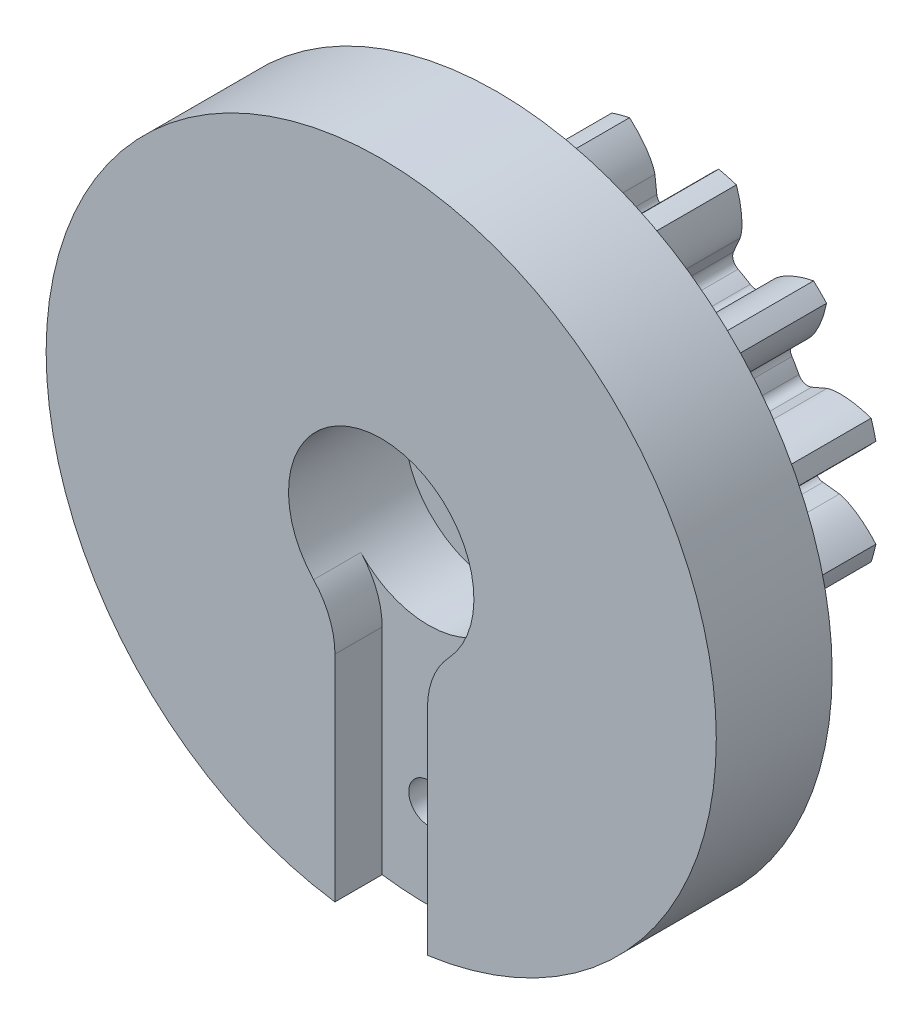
from build123d import *
from build123d.topology import SkipClean

# Parameters (mm, degrees)
BOSS_EXTRUDE1_DEPTH      = 6.35
BOSS_EXTRUDE1_DEPTH_BACK = 6.35
SKETCH3_R                = 7.408333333
SKETCH5_W                = 6.35
SKETCH5_H                = 2.582333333
SKETCH5_W_2              = 12.7
SKETCH5_H_2              = 2.38125
CUT_EXTRUDE1_DEPTH       = 13.251094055
FILLET1_R                = 0.355076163
CIRPATTERN1_COUNT        = 12
FILLET1_OF_CIRPATTERN1_R = 0.355076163
SKETCH6_R                = 9.160380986
CUT_EXTRUDE2_DEPTH       = 6.35
SCALE1_SCALE             = 2.25
SKETCH7_R                = 2.749999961
BOSS_EXTRUDE4_DEPTH      = 3
SKETCH10_R               = 27.0383
SKETCH10_R_2             = 7.4803
SKETCH10_R_3             = 1.5875
BOSS_EXTRUDE5_DEPTH      = 2.54
BOSS_EXTRUDE6_DEPTH      = 3.81


with BuildPart() as part:
    # Sketch3 → Boss-Extrude1 (new, two sides: drawn at the far end of the back side and taken through both)
    with BuildSketch(Plane.XY.offset(-BOSS_EXTRUDE1_DEPTH_BACK)):
        Circle(SKETCH3_R)
    extrude(amount=BOSS_EXTRUDE1_DEPTH + BOSS_EXTRUDE1_DEPTH_BACK)

    # Sketch5 → Cut-Revolve1 (revolve, cut)
    with BuildSketch(Plane(origin=(0, 0, 0), x_dir=(0, 0, -1), z_dir=(1, 0, 0)), mode=Mode.PRIVATE) as cut_revolve1_sk:
        with Locations((-3.175, 6.117166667)):
            Rectangle(SKETCH5_W, SKETCH5_H)
        with Locations((0, 1.190625)):
            Rectangle(SKETCH5_W_2, SKETCH5_H_2)
    revolve(cut_revolve1_sk.sketch.rotate(Axis((0, 0, 6.35), (0, 0, -1)), 90), axis=Axis((0, 0, 6.35), (0, 0, -1)), mode=Mode.SUBTRACT)

    # Sketch4 → Cut-Extrude1 (cut, symmetric)
    with BuildSketch(Plane.XY):
        with BuildLine():
            Line((4.993301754, 0.581811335), (5.926950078, 0.690598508))
            add(Edge.make_bspline(
                [(5.926950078, 0.690598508), (5.929318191, 0.690911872), (5.935944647, 0.691904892), (5.948407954, 0.694232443), (5.96863478, 0.69866684), (5.994230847, 0.70524939), (6.027084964, 0.714822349), (6.065467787, 0.727462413), (6.107282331, 0.74277265), (6.152345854, 0.760950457), (6.196898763, 0.780422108), (6.240942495, 0.801081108), (6.284441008, 0.822769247), (6.336662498, 0.8503395), (6.398612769, 0.885198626), (6.469984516, 0.92853373), (6.54965538, 0.980716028), (6.629400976, 1.037091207), (6.706647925, 1.095172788), (6.78320647, 1.156800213), (6.856219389, 1.218511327), (6.930432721, 1.285554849), (6.998115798, 1.348944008), (7.07205666, 1.423150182), (7.131183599, 1.483972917), (7.190627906, 1.549410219), (7.219315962, 1.581641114), (7.233873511, 1.598273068)],
                knots=[0, 0, 0, 0, 0, 0.005376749, 0.015083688, 0.02853182, 0.046610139, 0.064854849, 0.092110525, 0.119476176, 0.146842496, 0.174208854, 0.201574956, 0.228941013, 0.256307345, 0.307035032, 0.361767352, 0.416499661, 0.471231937, 0.525964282, 0.580696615, 0.635428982, 0.690161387, 0.744893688, 0.799626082, 0.854358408, 0.909090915, 0.909090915, 0.909090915, 0.909090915, 0.909090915], degree=4))
            ThreePointArc((7.233873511, 1.598273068), (7.408333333, 0), (7.233873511, -1.598273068))
            add(Edge.make_bspline(
                [(5.926950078, -0.690598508), (5.929318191, -0.690911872), (5.935944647, -0.691904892), (5.948407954, -0.694232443), (5.96863478, -0.69866684), (5.994230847, -0.70524939), (6.027084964, -0.714822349), (6.065467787, -0.727462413), (6.107282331, -0.74277265), (6.152345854, -0.760950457), (6.196898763, -0.780422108), (6.240942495, -0.801081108), (6.284441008, -0.822769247), (6.336662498, -0.8503395), (6.398612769, -0.885198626), (6.469984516, -0.92853373), (6.54965538, -0.980716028), (6.629400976, -1.037091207), (6.706647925, -1.095172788), (6.78320647, -1.156800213), (6.856219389, -1.218511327), (6.930432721, -1.285554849), (6.998115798, -1.348944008), (7.07205666, -1.423150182), (7.131183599, -1.483972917), (7.190627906, -1.549410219), (7.219315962, -1.581641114), (7.233873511, -1.598273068)],
                knots=[0, 0, 0, 0, 0, 0.005376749, 0.015083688, 0.02853182, 0.046610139, 0.064854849, 0.092110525, 0.119476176, 0.146842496, 0.174208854, 0.201574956, 0.228941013, 0.256307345, 0.307035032, 0.361767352, 0.416499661, 0.471231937, 0.525964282, 0.580696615, 0.635428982, 0.690161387, 0.744893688, 0.799626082, 0.854358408, 0.909090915, 0.909090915, 0.909090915, 0.909090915, 0.909090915], degree=4))
            Line((5.926950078, -0.690598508), (4.993301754, -0.581811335))
            ThreePointArc((4.993301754, -0.581811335), (5.027083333, 0), (4.993301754, 0.581811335))
        make_face()
    cut_extrude1 = extrude(amount=CUT_EXTRUDE1_DEPTH, both=True, mode=Mode.SUBTRACT)

    # Fillet1
    fillet1_edges = [part.edges().sort_by_distance(p)[0] for p in [
        (4.993301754, -0.581811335, -3.175),
        (4.993301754, 0.581811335, -3.175),
    ]]
    fillet(fillet1_edges, radius=FILLET1_R)

    # CirPattern1: Cut-Extrude1 ×12 about axis
    cirpattern1_axis = Axis((0, 0, 6.35), (0, 0, -1))
    for i in range(1, CIRPATTERN1_COUNT):
        add(cut_extrude1.rotate(cirpattern1_axis, i * 360 / CIRPATTERN1_COUNT), mode=Mode.SUBTRACT)

    # Fillet1 of CirPattern1
    fillet1_of_cirpattern1_edges = [part.edges().sort_by_distance(p)[0] for p in [
        (4.0334205, -3.000514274, -3.175),
        (4.615231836, -1.99278748, -3.175),
        (1.99278748, -4.615231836, -3.175),
        (3.000514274, -4.0334205, -3.175),
        (-0.581811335, -4.993301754, -3.175),
        (0.581811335, -4.993301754, -3.175),
        (-3.000514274, -4.0334205, -3.175),
        (-1.99278748, -4.615231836, -3.175),
        (-4.615231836, -1.99278748, -3.175),
        (-4.0334205, -3.000514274, -3.175),
        (-4.993301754, 0.581811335, -3.175),
        (-4.993301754, -0.581811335, -3.175),
        (-4.0334205, 3.000514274, -3.175),
        (-4.615231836, 1.99278748, -3.175),
        (-1.99278748, 4.615231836, -3.175),
        (-3.000514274, 4.0334205, -3.175),
        (0.581811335, 4.993301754, -3.175),
        (-0.581811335, 4.993301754, -3.175),
        (3.000514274, 4.0334205, -3.175),
        (1.99278748, 4.615231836, -3.175),
        (4.615231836, 1.99278748, -3.175),
        (4.0334205, 3.000514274, -3.175),
    ]]
    fillet(fillet1_of_cirpattern1_edges, radius=FILLET1_OF_CIRPATTERN1_R)

    # Sketch6 → Cut-Extrude2 (cut)
    with BuildSketch(Plane.XY.offset(6.35)):
        Circle(SKETCH6_R)
    extrude(amount=-CUT_EXTRUDE2_DEPTH, mode=Mode.SUBTRACT)


with BuildPart() as part_1:
    # Scale1: scaled about (-1e-08, 0, -3.174999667)
    add(part.part.scale(SCALE1_SCALE).moved(Location((1.2e-08, 0, 3.968749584))))

    # Sketch7 → Boss-Extrude4 (add)
    with BuildSketch(Plane.XY.offset(3.968746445)):
        with BuildLine():
            ThreePointArc((3.7338, -26.779253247), (0, 27.0383), (-3.7338, -26.779253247))
            ThreePointArc((-3.7338, -26.779253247), (0, -27.0383), (3.7338, -26.779253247))
        make_face()
        with Locations((0, -19.9009)):
            Circle(SKETCH7_R, mode=Mode.SUBTRACT)
        with BuildLine():
            ThreePointArc((3.7338, -6.481791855), (0, 7.4803), (-3.7338, -6.481791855))
            ThreePointArc((-3.7338, -6.481791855), (0, -7.4803), (3.7338, -6.481791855))
        make_face(mode=Mode.SUBTRACT)
    extrude(amount=BOSS_EXTRUDE4_DEPTH)

    # Sketch10 → Boss-Extrude5 (add)
    with BuildSketch(Plane.XY.offset(6.968746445)):
        with Locations(Location((0, 0, 0), (0, 0, 180))):
            Circle(SKETCH10_R)
        Circle(SKETCH10_R_2, mode=Mode.SUBTRACT)
        with Locations((0, -19.9009)):
            Circle(SKETCH10_R_3, mode=Mode.SUBTRACT)
    extrude(amount=BOSS_EXTRUDE5_DEPTH)

    # Sketch12 → Boss-Extrude6 (add)
    with SkipClean():  # the faces are left unmerged after this step: merging them gives an invalid solid
        with BuildSketch(Plane.XY.offset(9.508746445)):
            with BuildLine():
                Line((3.7338, -9.465419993), (3.7338, -26.779253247))
                ThreePointArc((3.7338, -26.779253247), (26.628963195, 4.687001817), (-5.634233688, 26.444755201))
                ThreePointArc((-5.634233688, 26.444755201), (-27.021080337, -0.964823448), (-3.7338, -26.779253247))
                Line((-3.7338, -26.779253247), (-3.7338, -9.465419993))
                ThreePointArc((-3.7338, -9.465419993), (-4.179479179, -7.128435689), (-5.453956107, -5.119497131))
                ThreePointArc((-5.453956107, -5.119497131), (0, 7.4803), (5.453956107, -5.119497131))
                ThreePointArc((5.453956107, -5.119497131), (4.179479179, -7.128435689), (3.7338, -9.465419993))
            make_face()
        extrude(amount=BOSS_EXTRUDE6_DEPTH)


solid = part_1.part
